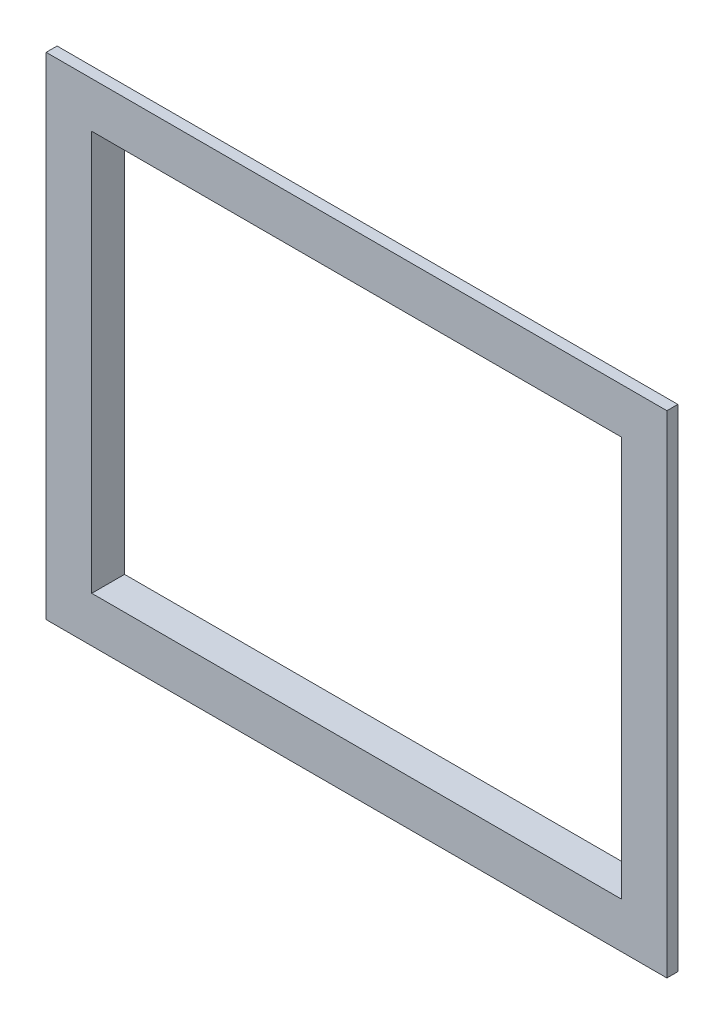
ISO-10303-21;
HEADER;
FILE_DESCRIPTION(('STEP AP214'),'2;1');
FILE_NAME('part.step','',(''),(''),'','','');
FILE_SCHEMA(('AUTOMOTIVE_DESIGN { 1 0 10303 214 1 1 1 1 }'));
ENDSEC;
DATA;
#1=APPLICATION_CONTEXT('core data for automotive mechanical design processes');
#2=APPLICATION_PROTOCOL_DEFINITION('international standard','automotive_design',2000,#1);
#3=PRODUCT_CONTEXT('',#1,'mechanical');
#4=PRODUCT('Part','Part','',(#3));
#5=PRODUCT_RELATED_PRODUCT_CATEGORY('part','',(#4));
#6=PRODUCT_DEFINITION_FORMATION('','',#4);
#7=PRODUCT_DEFINITION_CONTEXT('part definition',#1,'design');
#8=PRODUCT_DEFINITION('design','',#6,#7);
#9=PRODUCT_DEFINITION_SHAPE('','',#8);
#10=(LENGTH_UNIT() NAMED_UNIT(*) SI_UNIT(.MILLI.,.METRE.));
#11=(NAMED_UNIT(*) PLANE_ANGLE_UNIT() SI_UNIT($,.RADIAN.));
#12=(NAMED_UNIT(*) SI_UNIT($,.STERADIAN.) SOLID_ANGLE_UNIT());
#13=UNCERTAINTY_MEASURE_WITH_UNIT(LENGTH_MEASURE(1.E-05),#10,'distance_accuracy_value','');
#14=(GEOMETRIC_REPRESENTATION_CONTEXT(3) GLOBAL_UNCERTAINTY_ASSIGNED_CONTEXT((#13)) GLOBAL_UNIT_ASSIGNED_CONTEXT((#10,
#11,#12)) REPRESENTATION_CONTEXT('',''));
#15=CARTESIAN_POINT('',(0.,0.,0.));
#16=DIRECTION('',(0.,0.,1.));
#17=DIRECTION('',(1.,0.,0.));
#18=AXIS2_PLACEMENT_3D('',#15,#16,#17);
#19=CARTESIAN_POINT('',(0.,0.,0.));
#20=DIRECTION('',(0.,0.,-1.));
#21=DIRECTION('',(-1.,0.,0.));
#22=AXIS2_PLACEMENT_3D('',#19,#20,#21);
#23=PLANE('',#22);
#24=DIRECTION('',(1.,0.,0.));
#25=VECTOR('',#24,1.);
#26=CARTESIAN_POINT('',(34.05,-26.95,0.));
#27=LINE('',#26,#25);
#28=CARTESIAN_POINT('',(-34.05,-26.95,0.));
#29=VERTEX_POINT('',#28);
#30=CARTESIAN_POINT('',(34.05,-26.95,0.));
#31=VERTEX_POINT('',#30);
#32=EDGE_CURVE('E209',#29,#31,#27,.T.);
#33=ORIENTED_EDGE('',*,*,#32,.F.);
#34=DIRECTION('',(0.,-1.,0.));
#35=VECTOR('',#34,1.);
#36=CARTESIAN_POINT('',(-34.05,-26.95,0.));
#37=LINE('',#36,#35);
#38=CARTESIAN_POINT('',(-34.05,26.95,0.));
#39=VERTEX_POINT('',#38);
#40=EDGE_CURVE('E214',#39,#29,#37,.T.);
#41=ORIENTED_EDGE('',*,*,#40,.F.);
#42=DIRECTION('',(-1.,0.,0.));
#43=VECTOR('',#42,1.);
#44=CARTESIAN_POINT('',(34.05,26.95,0.));
#45=LINE('',#44,#43);
#46=CARTESIAN_POINT('',(34.05,26.95,0.));
#47=VERTEX_POINT('',#46);
#48=EDGE_CURVE('E225',#47,#39,#45,.T.);
#49=ORIENTED_EDGE('',*,*,#48,.F.);
#50=DIRECTION('',(0.,1.,0.));
#51=VECTOR('',#50,1.);
#52=CARTESIAN_POINT('',(34.05,-26.95,0.));
#53=LINE('',#52,#51);
#54=EDGE_CURVE('E223',#31,#47,#53,.T.);
#55=ORIENTED_EDGE('',*,*,#54,.F.);
#56=EDGE_LOOP('',(#33,#41,#49,#55));
#57=FACE_BOUND('',#56,.T.);
#58=DIRECTION('',(0.,-1.,0.));
#59=VECTOR('',#58,1.);
#60=CARTESIAN_POINT('',(30.55,23.45,0.));
#61=LINE('',#60,#59);
#62=CARTESIAN_POINT('',(30.55,22.85,0.));
#63=VERTEX_POINT('',#62);
#64=CARTESIAN_POINT('',(30.55,-22.85,0.));
#65=VERTEX_POINT('',#64);
#66=EDGE_CURVE('E191',#63,#65,#61,.T.);
#67=ORIENTED_EDGE('',*,*,#66,.F.);
#68=CARTESIAN_POINT('',(29.95,22.85,0.));
#69=DIRECTION('',(0.,0.,-1.));
#70=DIRECTION('',(-1.,0.,0.));
#71=AXIS2_PLACEMENT_3D('',#68,#69,#70);
#72=CIRCLE('',#71,0.6);
#73=CARTESIAN_POINT('',(29.95,23.45,0.));
#74=VERTEX_POINT('',#73);
#75=EDGE_CURVE('E11',#63,#74,#72,.F.);
#76=ORIENTED_EDGE('',*,*,#75,.T.);
#77=DIRECTION('',(1.,0.,0.));
#78=VECTOR('',#77,1.);
#79=CARTESIAN_POINT('',(30.55,23.45,0.));
#80=LINE('',#79,#78);
#81=CARTESIAN_POINT('',(-29.95,23.45,0.));
#82=VERTEX_POINT('',#81);
#83=EDGE_CURVE('E175',#82,#74,#80,.T.);
#84=ORIENTED_EDGE('',*,*,#83,.F.);
#85=CARTESIAN_POINT('',(-29.95,22.85,0.));
#86=DIRECTION('',(0.,0.,-1.));
#87=DIRECTION('',(-1.,0.,0.));
#88=AXIS2_PLACEMENT_3D('',#85,#86,#87);
#89=CIRCLE('',#88,0.6);
#90=CARTESIAN_POINT('',(-30.55,22.85,0.));
#91=VERTEX_POINT('',#90);
#92=EDGE_CURVE('E41',#82,#91,#89,.F.);
#93=ORIENTED_EDGE('',*,*,#92,.T.);
#94=DIRECTION('',(0.,1.,0.));
#95=VECTOR('',#94,1.);
#96=CARTESIAN_POINT('',(-30.55,23.45,0.));
#97=LINE('',#96,#95);
#98=CARTESIAN_POINT('',(-30.55,-22.85,0.));
#99=VERTEX_POINT('',#98);
#100=EDGE_CURVE('E180',#99,#91,#97,.T.);
#101=ORIENTED_EDGE('',*,*,#100,.F.);
#102=CARTESIAN_POINT('',(-29.95,-22.85,0.));
#103=DIRECTION('',(0.,0.,-1.));
#104=DIRECTION('',(-1.,0.,0.));
#105=AXIS2_PLACEMENT_3D('',#102,#103,#104);
#106=CIRCLE('',#105,0.6);
#107=CARTESIAN_POINT('',(-29.95,-23.45,0.));
#108=VERTEX_POINT('',#107);
#109=EDGE_CURVE('E268',#99,#108,#106,.F.);
#110=ORIENTED_EDGE('',*,*,#109,.T.);
#111=DIRECTION('',(-1.,0.,0.));
#112=VECTOR('',#111,1.);
#113=CARTESIAN_POINT('',(30.55,-23.45,0.));
#114=LINE('',#113,#112);
#115=CARTESIAN_POINT('',(29.95,-23.45,0.));
#116=VERTEX_POINT('',#115);
#117=EDGE_CURVE('E194',#116,#108,#114,.T.);
#118=ORIENTED_EDGE('',*,*,#117,.F.);
#119=CARTESIAN_POINT('',(29.95,-22.85,0.));
#120=DIRECTION('',(0.,0.,-1.));
#121=DIRECTION('',(-1.,0.,0.));
#122=AXIS2_PLACEMENT_3D('',#119,#120,#121);
#123=CIRCLE('',#122,0.6);
#124=EDGE_CURVE('E266',#116,#65,#123,.F.);
#125=ORIENTED_EDGE('',*,*,#124,.T.);
#126=EDGE_LOOP('',(#67,#76,#84,#93,#101,#110,#118,#125));
#127=FACE_BOUND('',#126,.T.);
#128=ADVANCED_FACE('F33',(#57,#127),#23,.T.);
#129=CARTESIAN_POINT('',(0.,0.,1.2));
#130=DIRECTION('',(0.,0.,-1.));
#131=DIRECTION('',(-1.,0.,0.));
#132=AXIS2_PLACEMENT_3D('',#129,#130,#131);
#133=PLANE('',#132);
#134=DIRECTION('',(1.,0.,0.));
#135=VECTOR('',#134,1.);
#136=CARTESIAN_POINT('',(34.05,-26.95,1.2));
#137=LINE('',#136,#135);
#138=CARTESIAN_POINT('',(-34.05,-26.95,1.2));
#139=VERTEX_POINT('',#138);
#140=CARTESIAN_POINT('',(34.05,-26.95,1.2));
#141=VERTEX_POINT('',#140);
#142=EDGE_CURVE('E210',#139,#141,#137,.T.);
#143=ORIENTED_EDGE('',*,*,#142,.T.);
#144=DIRECTION('',(0.,1.,0.));
#145=VECTOR('',#144,1.);
#146=CARTESIAN_POINT('',(34.05,-26.95,1.2));
#147=LINE('',#146,#145);
#148=CARTESIAN_POINT('',(34.05,26.95,1.2));
#149=VERTEX_POINT('',#148);
#150=EDGE_CURVE('E213',#141,#149,#147,.T.);
#151=ORIENTED_EDGE('',*,*,#150,.T.);
#152=DIRECTION('',(-1.,0.,0.));
#153=VECTOR('',#152,1.);
#154=CARTESIAN_POINT('',(34.05,26.95,1.2));
#155=LINE('',#154,#153);
#156=CARTESIAN_POINT('',(-34.05,26.95,1.2));
#157=VERTEX_POINT('',#156);
#158=EDGE_CURVE('E216',#149,#157,#155,.T.);
#159=ORIENTED_EDGE('',*,*,#158,.T.);
#160=DIRECTION('',(0.,-1.,0.));
#161=VECTOR('',#160,1.);
#162=CARTESIAN_POINT('',(-34.05,-26.95,1.2));
#163=LINE('',#162,#161);
#164=EDGE_CURVE('E218',#157,#139,#163,.T.);
#165=ORIENTED_EDGE('',*,*,#164,.T.);
#166=EDGE_LOOP('',(#143,#151,#159,#165));
#167=FACE_BOUND('',#166,.T.);
#168=DIRECTION('',(0.,-1.,0.));
#169=VECTOR('',#168,1.);
#170=CARTESIAN_POINT('',(-29.05,-21.95,1.2));
#171=LINE('',#170,#169);
#172=CARTESIAN_POINT('',(-29.05,21.95,1.2));
#173=VERTEX_POINT('',#172);
#174=CARTESIAN_POINT('',(-29.05,-21.95,1.2));
#175=VERTEX_POINT('',#174);
#176=EDGE_CURVE('E189',#173,#175,#171,.T.);
#177=ORIENTED_EDGE('',*,*,#176,.F.);
#178=DIRECTION('',(-1.,0.,0.));
#179=VECTOR('',#178,1.);
#180=CARTESIAN_POINT('',(29.05,21.95,1.2));
#181=LINE('',#180,#179);
#182=CARTESIAN_POINT('',(29.05,21.95,1.2));
#183=VERTEX_POINT('',#182);
#184=EDGE_CURVE('E203',#183,#173,#181,.T.);
#185=ORIENTED_EDGE('',*,*,#184,.F.);
#186=DIRECTION('',(0.,1.,0.));
#187=VECTOR('',#186,1.);
#188=CARTESIAN_POINT('',(29.05,-21.95,1.2));
#189=LINE('',#188,#187);
#190=CARTESIAN_POINT('',(29.05,-21.95,1.2));
#191=VERTEX_POINT('',#190);
#192=EDGE_CURVE('E201',#191,#183,#189,.T.);
#193=ORIENTED_EDGE('',*,*,#192,.F.);
#194=DIRECTION('',(1.,0.,0.));
#195=VECTOR('',#194,1.);
#196=CARTESIAN_POINT('',(29.05,-21.95,1.2));
#197=LINE('',#196,#195);
#198=EDGE_CURVE('E153',#175,#191,#197,.T.);
#199=ORIENTED_EDGE('',*,*,#198,.F.);
#200=EDGE_LOOP('',(#177,#185,#193,#199));
#201=FACE_BOUND('',#200,.T.);
#202=ADVANCED_FACE('F308',(#167,#201),#133,.F.);
#203=CARTESIAN_POINT('',(34.05,-26.95,1.2));
#204=DIRECTION('',(0.,1.,0.));
#205=DIRECTION('',(0.,0.,1.));
#206=AXIS2_PLACEMENT_3D('',#203,#204,#205);
#207=PLANE('',#206);
#208=ORIENTED_EDGE('',*,*,#32,.T.);
#209=DIRECTION('',(0.,0.,-1.));
#210=VECTOR('',#209,1.);
#211=CARTESIAN_POINT('',(34.05,-26.95,1.2));
#212=LINE('',#211,#210);
#213=EDGE_CURVE('E236',#141,#31,#212,.T.);
#214=ORIENTED_EDGE('',*,*,#213,.F.);
#215=ORIENTED_EDGE('',*,*,#142,.F.);
#216=DIRECTION('',(0.,0.,-1.));
#217=VECTOR('',#216,1.);
#218=CARTESIAN_POINT('',(-34.05,-26.95,1.2));
#219=LINE('',#218,#217);
#220=EDGE_CURVE('E220',#139,#29,#219,.T.);
#221=ORIENTED_EDGE('',*,*,#220,.T.);
#222=EDGE_LOOP('',(#208,#214,#215,#221));
#223=FACE_BOUND('',#222,.T.);
#224=ADVANCED_FACE('F314',(#223),#207,.F.);
#225=CARTESIAN_POINT('',(34.05,-26.95,1.2));
#226=DIRECTION('',(-1.,0.,0.));
#227=DIRECTION('',(0.,0.,1.));
#228=AXIS2_PLACEMENT_3D('',#225,#226,#227);
#229=PLANE('',#228);
#230=ORIENTED_EDGE('',*,*,#54,.T.);
#231=DIRECTION('',(0.,0.,-1.));
#232=VECTOR('',#231,1.);
#233=CARTESIAN_POINT('',(34.05,26.95,1.2));
#234=LINE('',#233,#232);
#235=EDGE_CURVE('E233',#149,#47,#234,.T.);
#236=ORIENTED_EDGE('',*,*,#235,.F.);
#237=ORIENTED_EDGE('',*,*,#150,.F.);
#238=ORIENTED_EDGE('',*,*,#213,.T.);
#239=EDGE_LOOP('',(#230,#236,#237,#238));
#240=FACE_BOUND('',#239,.T.);
#241=ADVANCED_FACE('F328',(#240),#229,.F.);
#242=CARTESIAN_POINT('',(34.05,26.95,1.2));
#243=DIRECTION('',(0.,-1.,0.));
#244=DIRECTION('',(0.,0.,-1.));
#245=AXIS2_PLACEMENT_3D('',#242,#243,#244);
#246=PLANE('',#245);
#247=ORIENTED_EDGE('',*,*,#48,.T.);
#248=DIRECTION('',(0.,0.,-1.));
#249=VECTOR('',#248,1.);
#250=CARTESIAN_POINT('',(-34.05,26.95,1.2));
#251=LINE('',#250,#249);
#252=EDGE_CURVE('E230',#157,#39,#251,.T.);
#253=ORIENTED_EDGE('',*,*,#252,.F.);
#254=ORIENTED_EDGE('',*,*,#158,.F.);
#255=ORIENTED_EDGE('',*,*,#235,.T.);
#256=EDGE_LOOP('',(#247,#253,#254,#255));
#257=FACE_BOUND('',#256,.T.);
#258=ADVANCED_FACE('F324',(#257),#246,.F.);
#259=CARTESIAN_POINT('',(-34.05,-26.95,1.2));
#260=DIRECTION('',(1.,0.,0.));
#261=DIRECTION('',(0.,1.,0.));
#262=AXIS2_PLACEMENT_3D('',#259,#260,#261);
#263=PLANE('',#262);
#264=ORIENTED_EDGE('',*,*,#40,.T.);
#265=ORIENTED_EDGE('',*,*,#220,.F.);
#266=ORIENTED_EDGE('',*,*,#164,.F.);
#267=ORIENTED_EDGE('',*,*,#252,.T.);
#268=EDGE_LOOP('',(#264,#265,#266,#267));
#269=FACE_BOUND('',#268,.T.);
#270=ADVANCED_FACE('F320',(#269),#263,.F.);
#271=CARTESIAN_POINT('',(-29.05,-21.95,1.2));
#272=DIRECTION('',(1.,0.,0.));
#273=DIRECTION('',(0.,0.,-1.));
#274=AXIS2_PLACEMENT_3D('',#271,#272,#273);
#275=PLANE('',#274);
#276=DIRECTION('',(0.,0.,-1.));
#277=VECTOR('',#276,1.);
#278=CARTESIAN_POINT('',(-29.05,-21.95,1.2));
#279=LINE('',#278,#277);
#280=CARTESIAN_POINT('',(-29.05,-21.95,-2.4));
#281=VERTEX_POINT('',#280);
#282=EDGE_CURVE('E157',#175,#281,#279,.T.);
#283=ORIENTED_EDGE('',*,*,#282,.T.);
#284=DIRECTION('',(0.,1.,0.));
#285=VECTOR('',#284,1.);
#286=CARTESIAN_POINT('',(-29.05,21.95,-2.4));
#287=LINE('',#286,#285);
#288=CARTESIAN_POINT('',(-29.05,21.95,-2.4));
#289=VERTEX_POINT('',#288);
#290=EDGE_CURVE('E169',#281,#289,#287,.T.);
#291=ORIENTED_EDGE('',*,*,#290,.T.);
#292=DIRECTION('',(0.,0.,-1.));
#293=VECTOR('',#292,1.);
#294=CARTESIAN_POINT('',(-29.05,21.95,1.2));
#295=LINE('',#294,#293);
#296=EDGE_CURVE('E205',#173,#289,#295,.T.);
#297=ORIENTED_EDGE('',*,*,#296,.F.);
#298=ORIENTED_EDGE('',*,*,#176,.T.);
#299=EDGE_LOOP('',(#283,#291,#297,#298));
#300=FACE_BOUND('',#299,.T.);
#301=ADVANCED_FACE('F323',(#300),#275,.T.);
#302=CARTESIAN_POINT('',(29.05,-21.95,1.2));
#303=DIRECTION('',(0.,1.,0.));
#304=DIRECTION('',(0.,0.,1.));
#305=AXIS2_PLACEMENT_3D('',#302,#303,#304);
#306=PLANE('',#305);
#307=DIRECTION('',(0.,0.,-1.));
#308=VECTOR('',#307,1.);
#309=CARTESIAN_POINT('',(29.05,-21.95,1.2));
#310=LINE('',#309,#308);
#311=CARTESIAN_POINT('',(29.05,-21.95,-2.4));
#312=VERTEX_POINT('',#311);
#313=EDGE_CURVE('E145',#191,#312,#310,.T.);
#314=ORIENTED_EDGE('',*,*,#313,.T.);
#315=DIRECTION('',(-1.,0.,0.));
#316=VECTOR('',#315,1.);
#317=CARTESIAN_POINT('',(29.05,-21.95,-2.4));
#318=LINE('',#317,#316);
#319=EDGE_CURVE('E150',#312,#281,#318,.T.);
#320=ORIENTED_EDGE('',*,*,#319,.T.);
#321=ORIENTED_EDGE('',*,*,#282,.F.);
#322=ORIENTED_EDGE('',*,*,#198,.T.);
#323=EDGE_LOOP('',(#314,#320,#321,#322));
#324=FACE_BOUND('',#323,.T.);
#325=ADVANCED_FACE('F147',(#324),#306,.T.);
#326=CARTESIAN_POINT('',(29.05,-21.95,1.2));
#327=DIRECTION('',(-1.,0.,0.));
#328=DIRECTION('',(0.,0.,1.));
#329=AXIS2_PLACEMENT_3D('',#326,#327,#328);
#330=PLANE('',#329);
#331=DIRECTION('',(0.,0.,-1.));
#332=VECTOR('',#331,1.);
#333=CARTESIAN_POINT('',(29.05,21.95,1.2));
#334=LINE('',#333,#332);
#335=CARTESIAN_POINT('',(29.05,21.95,-2.4));
#336=VERTEX_POINT('',#335);
#337=EDGE_CURVE('E158',#183,#336,#334,.T.);
#338=ORIENTED_EDGE('',*,*,#337,.T.);
#339=DIRECTION('',(0.,-1.,0.));
#340=VECTOR('',#339,1.);
#341=CARTESIAN_POINT('',(29.05,21.95,-2.4));
#342=LINE('',#341,#340);
#343=EDGE_CURVE('E161',#336,#312,#342,.T.);
#344=ORIENTED_EDGE('',*,*,#343,.T.);
#345=ORIENTED_EDGE('',*,*,#313,.F.);
#346=ORIENTED_EDGE('',*,*,#192,.T.);
#347=EDGE_LOOP('',(#338,#344,#345,#346));
#348=FACE_BOUND('',#347,.T.);
#349=ADVANCED_FACE('F162',(#348),#330,.T.);
#350=CARTESIAN_POINT('',(29.05,21.95,1.2));
#351=DIRECTION('',(0.,-1.,0.));
#352=DIRECTION('',(0.,0.,-1.));
#353=AXIS2_PLACEMENT_3D('',#350,#351,#352);
#354=PLANE('',#353);
#355=ORIENTED_EDGE('',*,*,#296,.T.);
#356=DIRECTION('',(1.,0.,0.));
#357=VECTOR('',#356,1.);
#358=CARTESIAN_POINT('',(29.05,21.95,-2.4));
#359=LINE('',#358,#357);
#360=EDGE_CURVE('E171',#289,#336,#359,.T.);
#361=ORIENTED_EDGE('',*,*,#360,.T.);
#362=ORIENTED_EDGE('',*,*,#337,.F.);
#363=ORIENTED_EDGE('',*,*,#184,.T.);
#364=EDGE_LOOP('',(#355,#361,#362,#363));
#365=FACE_BOUND('',#364,.T.);
#366=ADVANCED_FACE('F352',(#365),#354,.T.);
#367=CARTESIAN_POINT('',(0.,0.,-2.4));
#368=DIRECTION('',(0.,0.,1.));
#369=DIRECTION('',(1.,0.,0.));
#370=AXIS2_PLACEMENT_3D('',#367,#368,#369);
#371=PLANE('',#370);
#372=DIRECTION('',(0.,-1.,0.));
#373=VECTOR('',#372,1.);
#374=CARTESIAN_POINT('',(30.55,23.45,-2.4));
#375=LINE('',#374,#373);
#376=CARTESIAN_POINT('',(30.55,22.85,-2.4));
#377=VERTEX_POINT('',#376);
#378=CARTESIAN_POINT('',(30.55,-22.85,-2.4));
#379=VERTEX_POINT('',#378);
#380=EDGE_CURVE('E179',#377,#379,#375,.T.);
#381=ORIENTED_EDGE('',*,*,#380,.T.);
#382=CARTESIAN_POINT('',(29.95,-22.85,-2.4));
#383=DIRECTION('',(0.,0.,1.));
#384=DIRECTION('',(1.,0.,0.));
#385=AXIS2_PLACEMENT_3D('',#382,#383,#384);
#386=CIRCLE('',#385,0.6);
#387=CARTESIAN_POINT('',(29.95,-23.45,-2.4));
#388=VERTEX_POINT('',#387);
#389=EDGE_CURVE('E255',#379,#388,#386,.F.);
#390=ORIENTED_EDGE('',*,*,#389,.T.);
#391=DIRECTION('',(-1.,0.,0.));
#392=VECTOR('',#391,1.);
#393=CARTESIAN_POINT('',(30.55,-23.45,-2.4));
#394=LINE('',#393,#392);
#395=CARTESIAN_POINT('',(-29.95,-23.45,-2.4));
#396=VERTEX_POINT('',#395);
#397=EDGE_CURVE('E183',#388,#396,#394,.T.);
#398=ORIENTED_EDGE('',*,*,#397,.T.);
#399=CARTESIAN_POINT('',(-29.95,-22.85,-2.4));
#400=DIRECTION('',(0.,0.,1.));
#401=DIRECTION('',(1.,0.,0.));
#402=AXIS2_PLACEMENT_3D('',#399,#400,#401);
#403=CIRCLE('',#402,0.6);
#404=CARTESIAN_POINT('',(-30.55,-22.85,-2.4));
#405=VERTEX_POINT('',#404);
#406=EDGE_CURVE('E253',#396,#405,#403,.F.);
#407=ORIENTED_EDGE('',*,*,#406,.T.);
#408=DIRECTION('',(0.,1.,0.));
#409=VECTOR('',#408,1.);
#410=CARTESIAN_POINT('',(-30.55,23.45,-2.4));
#411=LINE('',#410,#409);
#412=CARTESIAN_POINT('',(-30.55,22.85,-2.4));
#413=VERTEX_POINT('',#412);
#414=EDGE_CURVE('E186',#405,#413,#411,.T.);
#415=ORIENTED_EDGE('',*,*,#414,.T.);
#416=CARTESIAN_POINT('',(-29.95,22.85,-2.4));
#417=DIRECTION('',(0.,0.,1.));
#418=DIRECTION('',(1.,0.,0.));
#419=AXIS2_PLACEMENT_3D('',#416,#417,#418);
#420=CIRCLE('',#419,0.6);
#421=CARTESIAN_POINT('',(-29.95,23.45,-2.4));
#422=VERTEX_POINT('',#421);
#423=EDGE_CURVE('E251',#413,#422,#420,.F.);
#424=ORIENTED_EDGE('',*,*,#423,.T.);
#425=DIRECTION('',(1.,0.,0.));
#426=VECTOR('',#425,1.);
#427=CARTESIAN_POINT('',(30.55,23.45,-2.4));
#428=LINE('',#427,#426);
#429=CARTESIAN_POINT('',(29.95,23.45,-2.4));
#430=VERTEX_POINT('',#429);
#431=EDGE_CURVE('E176',#422,#430,#428,.T.);
#432=ORIENTED_EDGE('',*,*,#431,.T.);
#433=CARTESIAN_POINT('',(29.95,22.85,-2.4));
#434=DIRECTION('',(0.,0.,1.));
#435=DIRECTION('',(1.,0.,0.));
#436=AXIS2_PLACEMENT_3D('',#433,#434,#435);
#437=CIRCLE('',#436,0.6);
#438=EDGE_CURVE('E249',#430,#377,#437,.F.);
#439=ORIENTED_EDGE('',*,*,#438,.T.);
#440=EDGE_LOOP('',(#381,#390,#398,#407,#415,#424,#432,#439));
#441=FACE_BOUND('',#440,.T.);
#442=ORIENTED_EDGE('',*,*,#343,.F.);
#443=ORIENTED_EDGE('',*,*,#360,.F.);
#444=ORIENTED_EDGE('',*,*,#290,.F.);
#445=ORIENTED_EDGE('',*,*,#319,.F.);
#446=EDGE_LOOP('',(#442,#443,#444,#445));
#447=FACE_BOUND('',#446,.T.);
#448=ADVANCED_FACE('F167',(#441,#447),#371,.F.);
#449=CARTESIAN_POINT('',(30.55,23.45,-2.4));
#450=DIRECTION('',(0.,-1.,0.));
#451=DIRECTION('',(0.,0.,-1.));
#452=AXIS2_PLACEMENT_3D('',#449,#450,#451);
#453=PLANE('',#452);
#454=ORIENTED_EDGE('',*,*,#431,.F.);
#455=DIRECTION('',(0.,0.,1.));
#456=VECTOR('',#455,1.);
#457=CARTESIAN_POINT('',(-29.95,23.45,-2.4));
#458=LINE('',#457,#456);
#459=EDGE_CURVE('E264',#422,#82,#458,.T.);
#460=ORIENTED_EDGE('',*,*,#459,.T.);
#461=ORIENTED_EDGE('',*,*,#83,.T.);
#462=DIRECTION('',(0.,0.,1.));
#463=VECTOR('',#462,1.);
#464=CARTESIAN_POINT('',(29.95,23.45,-2.4));
#465=LINE('',#464,#463);
#466=EDGE_CURVE('E262',#74,#430,#465,.F.);
#467=ORIENTED_EDGE('',*,*,#466,.T.);
#468=EDGE_LOOP('',(#454,#460,#461,#467));
#469=FACE_BOUND('',#468,.T.);
#470=ADVANCED_FACE('F280',(#469),#453,.F.);
#471=CARTESIAN_POINT('',(30.55,23.45,-2.4));
#472=DIRECTION('',(-1.,0.,0.));
#473=DIRECTION('',(0.,0.,1.));
#474=AXIS2_PLACEMENT_3D('',#471,#472,#473);
#475=PLANE('',#474);
#476=ORIENTED_EDGE('',*,*,#66,.T.);
#477=DIRECTION('',(0.,0.,1.));
#478=VECTOR('',#477,1.);
#479=CARTESIAN_POINT('',(30.55,-22.85,-2.4));
#480=LINE('',#479,#478);
#481=EDGE_CURVE('E247',#65,#379,#480,.F.);
#482=ORIENTED_EDGE('',*,*,#481,.T.);
#483=ORIENTED_EDGE('',*,*,#380,.F.);
#484=DIRECTION('',(0.,0.,1.));
#485=VECTOR('',#484,1.);
#486=CARTESIAN_POINT('',(30.55,22.85,-2.4));
#487=LINE('',#486,#485);
#488=EDGE_CURVE('E244',#377,#63,#487,.T.);
#489=ORIENTED_EDGE('',*,*,#488,.T.);
#490=EDGE_LOOP('',(#476,#482,#483,#489));
#491=FACE_BOUND('',#490,.T.);
#492=ADVANCED_FACE('F287',(#491),#475,.F.);
#493=CARTESIAN_POINT('',(30.55,-23.45,-2.4));
#494=DIRECTION('',(0.,1.,0.));
#495=DIRECTION('',(0.,0.,1.));
#496=AXIS2_PLACEMENT_3D('',#493,#494,#495);
#497=PLANE('',#496);
#498=ORIENTED_EDGE('',*,*,#397,.F.);
#499=DIRECTION('',(0.,0.,1.));
#500=VECTOR('',#499,1.);
#501=CARTESIAN_POINT('',(29.95,-23.45,-2.4));
#502=LINE('',#501,#500);
#503=EDGE_CURVE('E241',#388,#116,#502,.T.);
#504=ORIENTED_EDGE('',*,*,#503,.T.);
#505=ORIENTED_EDGE('',*,*,#117,.T.);
#506=DIRECTION('',(0.,0.,1.));
#507=VECTOR('',#506,1.);
#508=CARTESIAN_POINT('',(-29.95,-23.45,-2.4));
#509=LINE('',#508,#507);
#510=EDGE_CURVE('E239',#108,#396,#509,.F.);
#511=ORIENTED_EDGE('',*,*,#510,.T.);
#512=EDGE_LOOP('',(#498,#504,#505,#511));
#513=FACE_BOUND('',#512,.T.);
#514=ADVANCED_FACE('F295',(#513),#497,.F.);
#515=CARTESIAN_POINT('',(-30.55,23.45,-2.4));
#516=DIRECTION('',(1.,0.,0.));
#517=DIRECTION('',(0.,0.,-1.));
#518=AXIS2_PLACEMENT_3D('',#515,#516,#517);
#519=PLANE('',#518);
#520=ORIENTED_EDGE('',*,*,#414,.F.);
#521=DIRECTION('',(0.,0.,1.));
#522=VECTOR('',#521,1.);
#523=CARTESIAN_POINT('',(-30.55,-22.85,-2.4));
#524=LINE('',#523,#522);
#525=EDGE_CURVE('E259',#405,#99,#524,.T.);
#526=ORIENTED_EDGE('',*,*,#525,.T.);
#527=ORIENTED_EDGE('',*,*,#100,.T.);
#528=DIRECTION('',(0.,0.,1.));
#529=VECTOR('',#528,1.);
#530=CARTESIAN_POINT('',(-30.55,22.85,-2.4));
#531=LINE('',#530,#529);
#532=EDGE_CURVE('E257',#91,#413,#531,.F.);
#533=ORIENTED_EDGE('',*,*,#532,.T.);
#534=EDGE_LOOP('',(#520,#526,#527,#533));
#535=FACE_BOUND('',#534,.T.);
#536=ADVANCED_FACE('F272',(#535),#519,.F.);
#537=CARTESIAN_POINT('',(29.95,-22.85,-2.4));
#538=DIRECTION('',(0.,0.,1.));
#539=DIRECTION('',(1.,0.,0.));
#540=AXIS2_PLACEMENT_3D('',#537,#538,#539);
#541=CYLINDRICAL_SURFACE('',#540,0.6);
#542=ORIENTED_EDGE('',*,*,#389,.F.);
#543=ORIENTED_EDGE('',*,*,#481,.F.);
#544=ORIENTED_EDGE('',*,*,#124,.F.);
#545=ORIENTED_EDGE('',*,*,#503,.F.);
#546=EDGE_LOOP('',(#542,#543,#544,#545));
#547=FACE_BOUND('',#546,.T.);
#548=ADVANCED_FACE('F290',(#547),#541,.T.);
#549=CARTESIAN_POINT('',(-29.95,-22.85,-2.4));
#550=DIRECTION('',(0.,0.,1.));
#551=DIRECTION('',(1.,0.,0.));
#552=AXIS2_PLACEMENT_3D('',#549,#550,#551);
#553=CYLINDRICAL_SURFACE('',#552,0.6);
#554=ORIENTED_EDGE('',*,*,#406,.F.);
#555=ORIENTED_EDGE('',*,*,#510,.F.);
#556=ORIENTED_EDGE('',*,*,#109,.F.);
#557=ORIENTED_EDGE('',*,*,#525,.F.);
#558=EDGE_LOOP('',(#554,#555,#556,#557));
#559=FACE_BOUND('',#558,.T.);
#560=ADVANCED_FACE('F299',(#559),#553,.T.);
#561=CARTESIAN_POINT('',(-29.95,22.85,-2.4));
#562=DIRECTION('',(0.,0.,1.));
#563=DIRECTION('',(1.,0.,0.));
#564=AXIS2_PLACEMENT_3D('',#561,#562,#563);
#565=CYLINDRICAL_SURFACE('',#564,0.6);
#566=ORIENTED_EDGE('',*,*,#423,.F.);
#567=ORIENTED_EDGE('',*,*,#532,.F.);
#568=ORIENTED_EDGE('',*,*,#92,.F.);
#569=ORIENTED_EDGE('',*,*,#459,.F.);
#570=EDGE_LOOP('',(#566,#567,#568,#569));
#571=FACE_BOUND('',#570,.T.);
#572=ADVANCED_FACE('F275',(#571),#565,.T.);
#573=CARTESIAN_POINT('',(29.95,22.85,-2.4));
#574=DIRECTION('',(0.,0.,1.));
#575=DIRECTION('',(1.,0.,0.));
#576=AXIS2_PLACEMENT_3D('',#573,#574,#575);
#577=CYLINDRICAL_SURFACE('',#576,0.6);
#578=ORIENTED_EDGE('',*,*,#438,.F.);
#579=ORIENTED_EDGE('',*,*,#466,.F.);
#580=ORIENTED_EDGE('',*,*,#75,.F.);
#581=ORIENTED_EDGE('',*,*,#488,.F.);
#582=EDGE_LOOP('',(#578,#579,#580,#581));
#583=FACE_BOUND('',#582,.T.);
#584=ADVANCED_FACE('F35',(#583),#577,.T.);
#585=CLOSED_SHELL('',(#128,#202,#224,#241,#258,#270,#301,#325,#349,#366,#448,#470,#492,#514,
#536,#548,#560,#572,#584));
#586=MANIFOLD_SOLID_BREP('B2',#585);
#587=ADVANCED_BREP_SHAPE_REPRESENTATION('',(#18,#586),#14);
#588=SHAPE_DEFINITION_REPRESENTATION(#9,#587);
ENDSEC;
END-ISO-10303-21;
